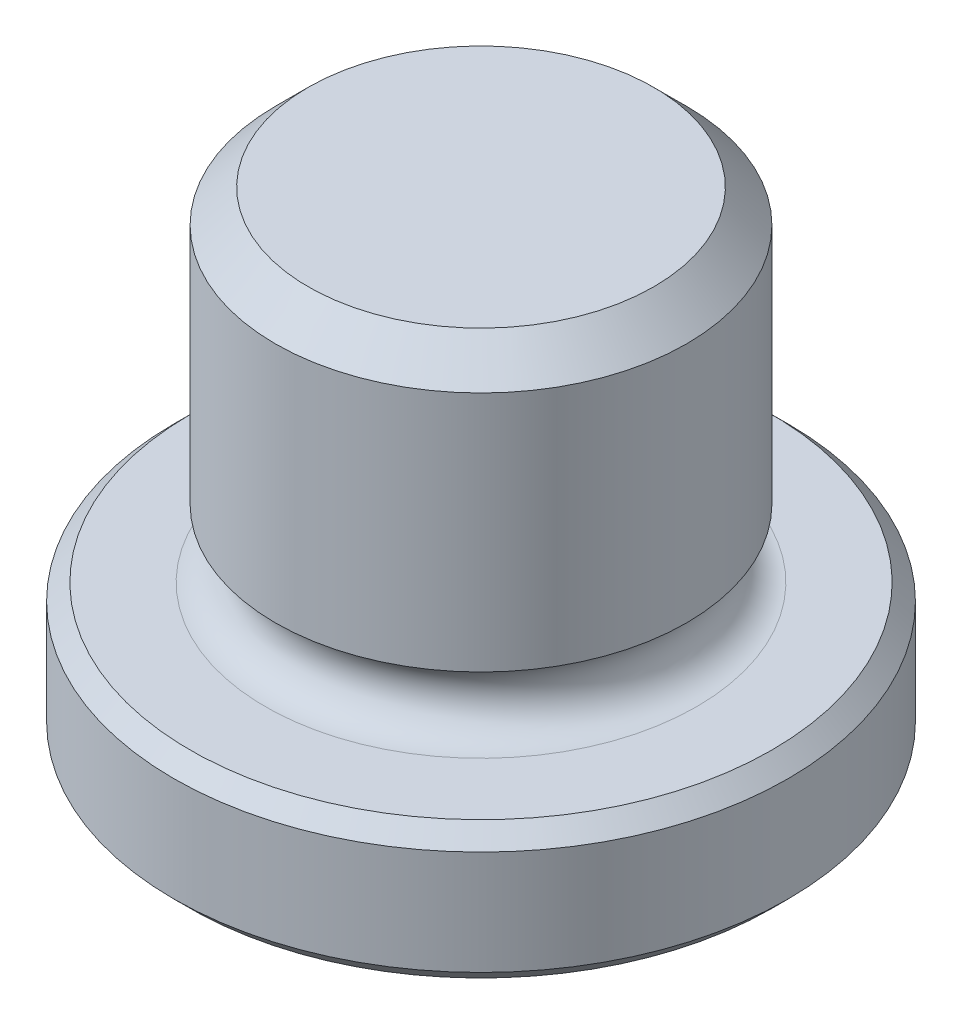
ISO-10303-21;
HEADER;
FILE_DESCRIPTION(('STEP AP214'),'2;1');
FILE_NAME('part.step','',(''),(''),'','','');
FILE_SCHEMA(('AUTOMOTIVE_DESIGN { 1 0 10303 214 1 1 1 1 }'));
ENDSEC;
DATA;
#1=APPLICATION_CONTEXT('core data for automotive mechanical design processes');
#2=APPLICATION_PROTOCOL_DEFINITION('international standard','automotive_design',2000,#1);
#3=PRODUCT_CONTEXT('',#1,'mechanical');
#4=PRODUCT('Part','Part','',(#3));
#5=PRODUCT_RELATED_PRODUCT_CATEGORY('part','',(#4));
#6=PRODUCT_DEFINITION_FORMATION('','',#4);
#7=PRODUCT_DEFINITION_CONTEXT('part definition',#1,'design');
#8=PRODUCT_DEFINITION('design','',#6,#7);
#9=PRODUCT_DEFINITION_SHAPE('','',#8);
#10=(LENGTH_UNIT() NAMED_UNIT(*) SI_UNIT(.MILLI.,.METRE.));
#11=(NAMED_UNIT(*) PLANE_ANGLE_UNIT() SI_UNIT($,.RADIAN.));
#12=(NAMED_UNIT(*) SI_UNIT($,.STERADIAN.) SOLID_ANGLE_UNIT());
#13=UNCERTAINTY_MEASURE_WITH_UNIT(LENGTH_MEASURE(1.E-05),#10,'distance_accuracy_value','');
#14=(GEOMETRIC_REPRESENTATION_CONTEXT(3) GLOBAL_UNCERTAINTY_ASSIGNED_CONTEXT((#13)) GLOBAL_UNIT_ASSIGNED_CONTEXT((#10,
#11,#12)) REPRESENTATION_CONTEXT('',''));
#15=CARTESIAN_POINT('',(0.,0.,0.));
#16=DIRECTION('',(0.,0.,1.));
#17=DIRECTION('',(1.,0.,0.));
#18=AXIS2_PLACEMENT_3D('',#15,#16,#17);
#19=CARTESIAN_POINT('',(4.0005,11.0998,0.));
#20=DIRECTION('',(0.,-1.,0.));
#21=DIRECTION('',(1.,0.,0.));
#22=AXIS2_PLACEMENT_3D('',#19,#20,#21);
#23=PLANE('',#22);
#24=CARTESIAN_POINT('',(0.,11.0998,0.));
#25=DIRECTION('',(0.,1.,0.));
#26=DIRECTION('',(-1.,0.,0.));
#27=AXIS2_PLACEMENT_3D('',#24,#25,#26);
#28=CIRCLE('',#27,4.0005);
#29=CARTESIAN_POINT('',(-4.0005,11.0998,0.));
#30=VERTEX_POINT('',#29);
#31=EDGE_CURVE('E52',#30,#30,#28,.T.);
#32=ORIENTED_EDGE('',*,*,#31,.T.);
#33=EDGE_LOOP('',(#32));
#34=FACE_BOUND('',#33,.T.);
#35=ADVANCED_FACE('F39',(#34),#23,.F.);
#36=CARTESIAN_POINT('',(0.,10.3378,0.));
#37=DIRECTION('',(0.,-1.,0.));
#38=DIRECTION('',(1.,0.,0.));
#39=AXIS2_PLACEMENT_3D('',#36,#37,#38);
#40=CONICAL_SURFACE('',#39,4.7625,0.785398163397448);
#41=ORIENTED_EDGE('',*,*,#31,.F.);
#42=EDGE_LOOP('',(#41));
#43=FACE_BOUND('',#42,.T.);
#44=CARTESIAN_POINT('',(0.,10.3378,0.));
#45=DIRECTION('',(0.,1.,0.));
#46=DIRECTION('',(-1.,0.,0.));
#47=AXIS2_PLACEMENT_3D('',#44,#45,#46);
#48=CIRCLE('',#47,4.7625);
#49=CARTESIAN_POINT('',(-4.7625,10.3378,0.));
#50=VERTEX_POINT('',#49);
#51=EDGE_CURVE('E143',#50,#50,#48,.T.);
#52=ORIENTED_EDGE('',*,*,#51,.T.);
#53=EDGE_LOOP('',(#52));
#54=FACE_BOUND('',#53,.T.);
#55=ADVANCED_FACE('F149',(#43,#54),#40,.T.);
#56=CARTESIAN_POINT('',(0.,11.0998,0.));
#57=DIRECTION('',(0.,1.,0.));
#58=DIRECTION('',(-1.,0.,0.));
#59=AXIS2_PLACEMENT_3D('',#56,#57,#58);
#60=CYLINDRICAL_SURFACE('',#59,4.7625);
#61=ORIENTED_EDGE('',*,*,#51,.F.);
#62=EDGE_LOOP('',(#61));
#63=FACE_BOUND('',#62,.T.);
#64=CARTESIAN_POINT('',(0.,4.7431750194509,0.));
#65=DIRECTION('',(0.,1.,0.));
#66=DIRECTION('',(-1.,0.,0.));
#67=AXIS2_PLACEMENT_3D('',#64,#65,#66);
#68=CIRCLE('',#67,4.7625);
#69=CARTESIAN_POINT('',(-4.7625,4.7431750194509,0.));
#70=VERTEX_POINT('',#69);
#71=EDGE_CURVE('E140',#70,#70,#68,.T.);
#72=ORIENTED_EDGE('',*,*,#71,.T.);
#73=EDGE_LOOP('',(#72));
#74=FACE_BOUND('',#73,.T.);
#75=ADVANCED_FACE('F152',(#63,#74),#60,.T.);
#76=CARTESIAN_POINT('',(0.,4.72675409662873,0.));
#77=DIRECTION('',(0.,1.,0.));
#78=DIRECTION('',(-1.,0.,0.));
#79=AXIS2_PLACEMENT_3D('',#76,#77,#78);
#80=CONICAL_SURFACE('',#79,4.71738388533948,1.22173047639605);
#81=ORIENTED_EDGE('',*,*,#71,.F.);
#82=EDGE_LOOP('',(#81));
#83=FACE_BOUND('',#82,.T.);
#84=CARTESIAN_POINT('',(0.,4.72675409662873,0.));
#85=DIRECTION('',(0.,1.,0.));
#86=DIRECTION('',(-1.,0.,0.));
#87=AXIS2_PLACEMENT_3D('',#84,#85,#86);
#88=CIRCLE('',#87,4.71738388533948);
#89=CARTESIAN_POINT('',(-4.71738388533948,4.72675409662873,0.));
#90=VERTEX_POINT('',#89);
#91=EDGE_CURVE('E137',#90,#90,#88,.T.);
#92=ORIENTED_EDGE('',*,*,#91,.T.);
#93=EDGE_LOOP('',(#92));
#94=FACE_BOUND('',#93,.T.);
#95=ADVANCED_FACE('F157',(#83,#94),#80,.T.);
#96=CARTESIAN_POINT('',(0.,3.975,0.));
#97=DIRECTION('',(0.,1.,0.));
#98=DIRECTION('',(-1.,0.,0.));
#99=AXIS2_PLACEMENT_3D('',#96,#97,#98);
#100=TOROIDAL_SURFACE('',#99,4.991,0.8);
#101=ORIENTED_EDGE('',*,*,#91,.F.);
#102=EDGE_LOOP('',(#101));
#103=FACE_BOUND('',#102,.T.);
#104=CARTESIAN_POINT('',(0.,3.175,0.));
#105=DIRECTION('',(0.,1.,0.));
#106=DIRECTION('',(-1.,0.,0.));
#107=AXIS2_PLACEMENT_3D('',#104,#105,#106);
#108=CIRCLE('',#107,4.991);
#109=CARTESIAN_POINT('',(-4.991,3.175,0.));
#110=VERTEX_POINT('',#109);
#111=EDGE_CURVE('E134',#110,#110,#108,.T.);
#112=ORIENTED_EDGE('',*,*,#111,.T.);
#113=EDGE_LOOP('',(#112));
#114=FACE_BOUND('',#113,.T.);
#115=ADVANCED_FACE('F163',(#103,#114),#100,.F.);
#116=CARTESIAN_POINT('',(6.731,3.175,0.));
#117=DIRECTION('',(0.,-1.,0.));
#118=DIRECTION('',(1.,0.,0.));
#119=AXIS2_PLACEMENT_3D('',#116,#117,#118);
#120=PLANE('',#119);
#121=ORIENTED_EDGE('',*,*,#111,.F.);
#122=EDGE_LOOP('',(#121));
#123=FACE_BOUND('',#122,.T.);
#124=CARTESIAN_POINT('',(0.,3.175,0.));
#125=DIRECTION('',(0.,1.,0.));
#126=DIRECTION('',(-1.,0.,0.));
#127=AXIS2_PLACEMENT_3D('',#124,#125,#126);
#128=CIRCLE('',#127,6.731);
#129=CARTESIAN_POINT('',(-6.731,3.175,0.));
#130=VERTEX_POINT('',#129);
#131=EDGE_CURVE('E131',#130,#130,#128,.T.);
#132=ORIENTED_EDGE('',*,*,#131,.T.);
#133=EDGE_LOOP('',(#132));
#134=FACE_BOUND('',#133,.T.);
#135=ADVANCED_FACE('F169',(#123,#134),#120,.F.);
#136=CARTESIAN_POINT('',(0.,2.794,0.));
#137=DIRECTION('',(0.,-1.,0.));
#138=DIRECTION('',(1.,0.,0.));
#139=AXIS2_PLACEMENT_3D('',#136,#137,#138);
#140=CONICAL_SURFACE('',#139,7.112,0.785398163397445);
#141=ORIENTED_EDGE('',*,*,#131,.F.);
#142=EDGE_LOOP('',(#141));
#143=FACE_BOUND('',#142,.T.);
#144=CARTESIAN_POINT('',(0.,2.794,0.));
#145=DIRECTION('',(0.,1.,0.));
#146=DIRECTION('',(-1.,0.,0.));
#147=AXIS2_PLACEMENT_3D('',#144,#145,#146);
#148=CIRCLE('',#147,7.112);
#149=CARTESIAN_POINT('',(-7.112,2.794,0.));
#150=VERTEX_POINT('',#149);
#151=EDGE_CURVE('E128',#150,#150,#148,.T.);
#152=ORIENTED_EDGE('',*,*,#151,.T.);
#153=EDGE_LOOP('',(#152));
#154=FACE_BOUND('',#153,.T.);
#155=ADVANCED_FACE('F175',(#143,#154),#140,.T.);
#156=CARTESIAN_POINT('',(0.,11.0998,0.));
#157=DIRECTION('',(0.,1.,0.));
#158=DIRECTION('',(-1.,0.,0.));
#159=AXIS2_PLACEMENT_3D('',#156,#157,#158);
#160=CYLINDRICAL_SURFACE('',#159,7.112);
#161=ORIENTED_EDGE('',*,*,#151,.F.);
#162=EDGE_LOOP('',(#161));
#163=FACE_BOUND('',#162,.T.);
#164=CARTESIAN_POINT('',(0.,0.380999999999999,0.));
#165=DIRECTION('',(0.,1.,0.));
#166=DIRECTION('',(-1.,0.,0.));
#167=AXIS2_PLACEMENT_3D('',#164,#165,#166);
#168=CIRCLE('',#167,7.112);
#169=CARTESIAN_POINT('',(-7.112,0.381,0.));
#170=VERTEX_POINT('',#169);
#171=EDGE_CURVE('E125',#170,#170,#168,.T.);
#172=ORIENTED_EDGE('',*,*,#171,.T.);
#173=EDGE_LOOP('',(#172));
#174=FACE_BOUND('',#173,.T.);
#175=ADVANCED_FACE('F181',(#163,#174),#160,.T.);
#176=CARTESIAN_POINT('',(0.,0.,0.));
#177=DIRECTION('',(0.,1.,0.));
#178=DIRECTION('',(-1.,0.,0.));
#179=AXIS2_PLACEMENT_3D('',#176,#177,#178);
#180=CONICAL_SURFACE('',#179,6.731,0.78539816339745);
#181=ORIENTED_EDGE('',*,*,#171,.F.);
#182=EDGE_LOOP('',(#181));
#183=FACE_BOUND('',#182,.T.);
#184=CARTESIAN_POINT('',(0.,0.,0.));
#185=DIRECTION('',(0.,1.,0.));
#186=DIRECTION('',(-1.,0.,0.));
#187=AXIS2_PLACEMENT_3D('',#184,#185,#186);
#188=CIRCLE('',#187,6.731);
#189=CARTESIAN_POINT('',(-6.731,0.,0.));
#190=VERTEX_POINT('',#189);
#191=EDGE_CURVE('E122',#190,#190,#188,.T.);
#192=ORIENTED_EDGE('',*,*,#191,.T.);
#193=EDGE_LOOP('',(#192));
#194=FACE_BOUND('',#193,.T.);
#195=ADVANCED_FACE('F187',(#183,#194),#180,.T.);
#196=CARTESIAN_POINT('',(0.,0.,0.));
#197=DIRECTION('',(0.,1.,0.));
#198=DIRECTION('',(-1.,0.,0.));
#199=AXIS2_PLACEMENT_3D('',#196,#197,#198);
#200=PLANE('',#199);
#201=CARTESIAN_POINT('',(0.,0.,0.));
#202=DIRECTION('',(0.,1.,0.));
#203=DIRECTION('',(-1.,0.,0.));
#204=AXIS2_PLACEMENT_3D('',#201,#202,#203);
#205=CIRCLE('',#204,3.00363065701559);
#206=CARTESIAN_POINT('',(-3.00363065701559,0.,0.));
#207=VERTEX_POINT('',#206);
#208=EDGE_CURVE('E421',#207,#207,#205,.T.);
#209=ORIENTED_EDGE('',*,*,#208,.T.);
#210=EDGE_LOOP('',(#209));
#211=FACE_BOUND('',#210,.T.);
#212=ORIENTED_EDGE('',*,*,#191,.F.);
#213=EDGE_LOOP('',(#212));
#214=FACE_BOUND('',#213,.T.);
#215=ADVANCED_FACE('F193',(#211,#214),#200,.F.);
#216=CARTESIAN_POINT('',(0.,1.524,0.));
#217=DIRECTION('',(0.,-1.,0.));
#218=DIRECTION('',(1.,0.,0.));
#219=AXIS2_PLACEMENT_3D('',#216,#217,#218);
#220=CONICAL_SURFACE('',#219,1.47963065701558,0.785398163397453);
#221=ORIENTED_EDGE('',*,*,#208,.F.);
#222=EDGE_LOOP('',(#221));
#223=FACE_BOUND('',#222,.T.);
#224=CARTESIAN_POINT('',(2.74974612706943,0.253884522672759,-0.000199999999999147));
#225=CARTESIAN_POINT('',(2.70248609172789,0.30110510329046,0.0816567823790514));
#226=CARTESIAN_POINT('',(2.65443579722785,0.345552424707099,0.164882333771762));
#227=CARTESIAN_POINT('',(2.556455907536,0.426934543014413,0.334588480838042));
#228=CARTESIAN_POINT('',(2.50651699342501,0.463824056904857,0.421085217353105));
#229=CARTESIAN_POINT('',(2.40581754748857,0.527016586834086,0.595501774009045));
#230=CARTESIAN_POINT('',(2.35508266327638,0.553478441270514,0.683377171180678));
#231=CARTESIAN_POINT('',(2.25249593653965,0.594248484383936,0.861062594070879));
#232=CARTESIAN_POINT('',(2.20064722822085,0.608587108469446,0.950867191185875));
#233=CARTESIAN_POINT('',(2.11128933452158,0.621524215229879,1.10563960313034));
#234=CARTESIAN_POINT('',(2.07389560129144,0.62343939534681,1.17040744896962));
#235=CARTESIAN_POINT('',(1.99916925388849,0.62021337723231,1.29983727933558));
#236=CARTESIAN_POINT('',(1.96183666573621,0.615069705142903,1.36449921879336));
#237=CARTESIAN_POINT('',(1.8875239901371,0.598018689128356,1.49321254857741));
#238=CARTESIAN_POINT('',(1.85054434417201,0.586103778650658,1.55726317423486));
#239=CARTESIAN_POINT('',(1.77722451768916,0.556164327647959,1.68425683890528));
#240=CARTESIAN_POINT('',(1.74088428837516,0.53814025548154,1.74719996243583));
#241=CARTESIAN_POINT('',(1.64780030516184,0.484631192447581,1.90842615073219));
#242=CARTESIAN_POINT('',(1.59163374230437,0.44511257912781,2.00570949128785));
#243=CARTESIAN_POINT('',(1.50904576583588,0.378399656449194,2.14875606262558));
#244=CARTESIAN_POINT('',(1.48182934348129,0.354959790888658,2.19589628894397));
#245=CARTESIAN_POINT('',(1.42790064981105,0.305943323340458,2.28930352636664));
#246=CARTESIAN_POINT('',(1.40118808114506,0.28036803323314,2.33557105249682));
#247=CARTESIAN_POINT('',(1.37469985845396,0.253884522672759,2.38145));
#248=B_SPLINE_CURVE_WITH_KNOTS('',3,(#224,#225,#226,#227,#228,#229,#230,#231,#232,#233,#234,
#235,#236,#237,#238,#239,#240,#241,#242,#243,#244,#245,#246,#247),.UNSPECIFIED.,.F.,.F.,(4,2,2,
2,2,2,2,2,2,2,2,4),(0.,0.31719661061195,0.63624146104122,0.950218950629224,1.26340583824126,
1.48752413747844,1.71172100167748,1.93616888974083,2.16059957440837,2.51709639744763,
2.69486147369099,2.87251813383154),.UNSPECIFIED.);
#249=CARTESIAN_POINT('',(2.74963065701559,0.253999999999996,0.));
#250=VERTEX_POINT('',#249);
#251=CARTESIAN_POINT('',(1.3748153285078,0.253999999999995,2.38125));
#252=VERTEX_POINT('',#251);
#253=EDGE_CURVE('E106',#250,#252,#248,.T.);
#254=ORIENTED_EDGE('',*,*,#253,.F.);
#255=CARTESIAN_POINT('',(1.37469985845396,0.253884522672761,-2.38145));
#256=CARTESIAN_POINT('',(1.4219598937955,0.301105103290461,-2.29959321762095));
#257=CARTESIAN_POINT('',(1.47001018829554,0.3455524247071,-2.21636766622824));
#258=CARTESIAN_POINT('',(1.56799007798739,0.426934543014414,-2.04666151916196));
#259=CARTESIAN_POINT('',(1.61792899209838,0.463824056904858,-1.9601647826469));
#260=CARTESIAN_POINT('',(1.71862843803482,0.527016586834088,-1.78574822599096));
#261=CARTESIAN_POINT('',(1.76936332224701,0.553478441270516,-1.69787282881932));
#262=CARTESIAN_POINT('',(1.87195004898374,0.594248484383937,-1.52018740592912));
#263=CARTESIAN_POINT('',(1.92379875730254,0.608587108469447,-1.43038280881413));
#264=CARTESIAN_POINT('',(2.01315665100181,0.621524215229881,-1.27561039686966));
#265=CARTESIAN_POINT('',(2.05055038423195,0.623439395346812,-1.21084255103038));
#266=CARTESIAN_POINT('',(2.1252767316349,0.620213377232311,-1.08141272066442));
#267=CARTESIAN_POINT('',(2.16260931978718,0.615069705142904,-1.01675078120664));
#268=CARTESIAN_POINT('',(2.23692199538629,0.598018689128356,-0.888037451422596));
#269=CARTESIAN_POINT('',(2.27390164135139,0.586103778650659,-0.823986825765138));
#270=CARTESIAN_POINT('',(2.34722146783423,0.55616432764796,-0.696993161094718));
#271=CARTESIAN_POINT('',(2.38356169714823,0.538140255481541,-0.634050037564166));
#272=CARTESIAN_POINT('',(2.47664568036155,0.484631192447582,-0.47282384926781));
#273=CARTESIAN_POINT('',(2.53281224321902,0.445112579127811,-0.375540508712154));
#274=CARTESIAN_POINT('',(2.61540021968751,0.378399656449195,-0.232493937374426));
#275=CARTESIAN_POINT('',(2.6426166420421,0.354959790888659,-0.185353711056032));
#276=CARTESIAN_POINT('',(2.69654533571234,0.30594332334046,-0.0919464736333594));
#277=CARTESIAN_POINT('',(2.72325790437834,0.280368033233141,-0.0456789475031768));
#278=CARTESIAN_POINT('',(2.74974612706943,0.253884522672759,0.000200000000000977));
#279=B_SPLINE_CURVE_WITH_KNOTS('',3,(#255,#256,#257,#258,#259,#260,#261,#262,#263,#264,#265,
#266,#267,#268,#269,#270,#271,#272,#273,#274,#275,#276,#277,#278),.UNSPECIFIED.,.F.,.F.,(4,2,2,
2,2,2,2,2,2,2,2,4),(0.,0.317196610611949,0.636241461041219,0.950218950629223,1.26340583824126,
1.48752413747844,1.71172100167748,1.93616888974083,2.16059957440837,2.51709639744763,
2.69486147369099,2.87251813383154),.UNSPECIFIED.);
#280=CARTESIAN_POINT('',(1.3748153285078,0.253999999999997,-2.38125));
#281=VERTEX_POINT('',#280);
#282=EDGE_CURVE('E407',#281,#250,#279,.T.);
#283=ORIENTED_EDGE('',*,*,#282,.F.);
#284=CARTESIAN_POINT('',(-4.51874635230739,-2.10414969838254,-2.38125));
#285=CARTESIAN_POINT('',(-4.38663427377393,-1.98731417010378,-2.38125));
#286=CARTESIAN_POINT('',(-4.2540032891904,-1.87105473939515,-2.38125));
#287=CARTESIAN_POINT('',(-3.98729113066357,-1.64010502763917,-2.38125));
#288=CARTESIAN_POINT('',(-3.85320939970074,-1.52541539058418,-2.38125));
#289=CARTESIAN_POINT('',(-3.58120888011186,-1.29636518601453,-2.38125));
#290=CARTESIAN_POINT('',(-3.44326280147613,-1.18203691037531,-2.38125));
#291=CARTESIAN_POINT('',(-3.16503340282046,-0.956313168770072,-2.38125));
#292=CARTESIAN_POINT('',(-3.02475060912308,-0.84491705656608,-2.38125));
#293=CARTESIAN_POINT('',(-2.74570464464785,-0.629770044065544,-2.38125));
#294=CARTESIAN_POINT('',(-2.60704314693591,-0.525888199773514,-2.38125));
#295=CARTESIAN_POINT('',(-2.32570246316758,-0.323481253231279,-2.38125));
#296=CARTESIAN_POINT('',(-2.18302070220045,-0.224959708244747,-2.38125));
#297=CARTESIAN_POINT('',(-1.89293051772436,-0.0363342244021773,-2.38125));
#298=CARTESIAN_POINT('',(-1.74554455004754,0.0538034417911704,-2.38125));
#299=CARTESIAN_POINT('',(-1.51934349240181,0.179648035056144,-2.38125));
#300=CARTESIAN_POINT('',(-1.44312941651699,0.220017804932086,-2.38125));
#301=CARTESIAN_POINT('',(-1.28875629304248,0.296833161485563,-2.38125));
#302=CARTESIAN_POINT('',(-1.21059781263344,0.333279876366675,-2.38125));
#303=CARTESIAN_POINT('',(-1.05758098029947,0.398944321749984,-2.38125));
#304=CARTESIAN_POINT('',(-0.982862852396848,0.428486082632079,-2.38125));
#305=CARTESIAN_POINT('',(-0.831548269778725,0.482355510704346,-2.38125));
#306=CARTESIAN_POINT('',(-0.754951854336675,0.506683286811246,-2.38125));
#307=CARTESIAN_POINT('',(-0.600423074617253,0.548967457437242,-2.38125));
#308=CARTESIAN_POINT('',(-0.522499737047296,0.566956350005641,-2.38125));
#309=CARTESIAN_POINT('',(-0.365343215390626,0.595754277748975,-2.38125));
#310=CARTESIAN_POINT('',(-0.286110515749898,0.606565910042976,-2.38125));
#311=CARTESIAN_POINT('',(-0.126006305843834,0.620397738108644,-2.38125));
#312=CARTESIAN_POINT('',(-0.0451265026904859,0.623324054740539,-2.38125));
#313=CARTESIAN_POINT('',(0.116505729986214,0.620902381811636,-2.38125));
#314=CARTESIAN_POINT('',(0.19725815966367,0.615554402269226,-2.38125));
#315=CARTESIAN_POINT('',(0.358132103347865,0.596932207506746,-2.38125));
#316=CARTESIAN_POINT('',(0.438250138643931,0.583628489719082,-2.38125));
#317=CARTESIAN_POINT('',(0.596966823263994,0.54991961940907,-2.38125));
#318=CARTESIAN_POINT('',(0.675565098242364,0.529512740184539,-2.38125));
#319=CARTESIAN_POINT('',(0.865071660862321,0.472361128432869,-2.38125));
#320=CARTESIAN_POINT('',(0.974997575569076,0.432377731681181,-2.38125));
#321=CARTESIAN_POINT('',(1.19093340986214,0.342994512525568,-2.38125));
#322=CARTESIAN_POINT('',(1.29694038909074,0.293587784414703,-2.38125));
#323=CARTESIAN_POINT('',(1.50629599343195,0.187414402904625,-2.38125));
#324=CARTESIAN_POINT('',(1.60961416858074,0.130588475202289,-2.38125));
#325=CARTESIAN_POINT('',(1.81316620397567,0.0117916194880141,-2.38125));
#326=CARTESIAN_POINT('',(1.9134011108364,-0.0501775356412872,-2.38125));
#327=CARTESIAN_POINT('',(2.12718035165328,-0.1881641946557,-2.38125));
#328=CARTESIAN_POINT('',(2.2402939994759,-0.264844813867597,-2.38125));
#329=CARTESIAN_POINT('',(2.46388500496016,-0.421973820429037,-2.38125));
#330=CARTESIAN_POINT('',(2.5743618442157,-0.502422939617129,-2.38125));
#331=CARTESIAN_POINT('',(2.79332742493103,-0.666212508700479,-2.38125));
#332=CARTESIAN_POINT('',(2.90181390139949,-0.749555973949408,-2.38125));
#333=CARTESIAN_POINT('',(3.11710515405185,-0.918389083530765,-2.38125));
#334=CARTESIAN_POINT('',(3.22390986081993,-1.00387881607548,-2.38125));
#335=CARTESIAN_POINT('',(3.43118511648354,-1.17248294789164,-2.38125));
#336=CARTESIAN_POINT('',(3.53171796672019,-1.25552094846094,-2.38125));
#337=CARTESIAN_POINT('',(3.73176727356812,-1.42281639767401,-2.38125));
#338=CARTESIAN_POINT('',(3.83128370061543,-1.50707388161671,-2.38125));
#339=CARTESIAN_POINT('',(4.02919746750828,-1.67634325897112,-2.38125));
#340=CARTESIAN_POINT('',(4.12759713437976,-1.76135243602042,-2.38125));
#341=CARTESIAN_POINT('',(4.32367703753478,-1.93218216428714,-2.38125));
#342=CARTESIAN_POINT('',(4.42135732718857,-2.01800265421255,-2.38125));
#343=CARTESIAN_POINT('',(4.51874635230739,-2.10414969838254,-2.38125));
#344=B_SPLINE_CURVE_WITH_KNOTS('',3,(#284,#285,#286,#287,#288,#289,#290,#291,#292,#293,#294,
#295,#296,#297,#298,#299,#300,#301,#302,#303,#304,#305,#306,#307,#308,#309,#310,#311,#312,#313,
#314,#315,#316,#317,#318,#319,#320,#321,#322,#323,#324,#325,#326,#327,#328,#329,#330,#331,#332,
#333,#334,#335,#336,#337,#338,#339,#340,#341,#342,#343),.UNSPECIFIED.,.F.,.F.,(4,2,2,2,2,2,2,2,
2,2,2,2,2,2,2,2,2,2,2,2,2,2,2,2,2,2,2,2,2,4),(0.,0.529099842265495,1.05841060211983,
1.59587609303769,2.13322211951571,2.65290165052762,3.17292195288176,3.69075054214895,
3.94940253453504,4.2079799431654,4.44886073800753,4.68973650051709,4.92935873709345,
5.16889421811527,5.4112691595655,5.65364380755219,5.89692288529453,6.14026114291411,
6.49055027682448,6.84109710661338,7.19463888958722,7.54805930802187,7.95791721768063,
8.36785505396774,8.7782335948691,9.18862903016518,9.57979454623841,9.97097140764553,
10.361071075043,10.7511415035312),.UNSPECIFIED.);
#345=CARTESIAN_POINT('',(-1.3748153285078,0.253999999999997,-2.38125));
#346=VERTEX_POINT('',#345);
#347=EDGE_CURVE('E402',#346,#281,#344,.T.);
#348=ORIENTED_EDGE('',*,*,#347,.F.);
#349=CARTESIAN_POINT('',(-2.74974612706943,0.25388452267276,0.000200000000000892));
#350=CARTESIAN_POINT('',(-2.70248609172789,0.301105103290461,-0.0816567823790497));
#351=CARTESIAN_POINT('',(-2.65443579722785,0.3455524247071,-0.16488233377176));
#352=CARTESIAN_POINT('',(-2.556455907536,0.426934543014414,-0.33458848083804));
#353=CARTESIAN_POINT('',(-2.50651699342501,0.463824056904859,-0.421085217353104));
#354=CARTESIAN_POINT('',(-2.40581754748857,0.527016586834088,-0.595501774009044));
#355=CARTESIAN_POINT('',(-2.35508266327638,0.553478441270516,-0.683377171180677));
#356=CARTESIAN_POINT('',(-2.25249593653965,0.594248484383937,-0.861062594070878));
#357=CARTESIAN_POINT('',(-2.20064722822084,0.608587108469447,-0.950867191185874));
#358=CARTESIAN_POINT('',(-2.11128933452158,0.621524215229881,-1.10563960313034));
#359=CARTESIAN_POINT('',(-2.07389560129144,0.623439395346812,-1.17040744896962));
#360=CARTESIAN_POINT('',(-1.99916925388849,0.620213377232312,-1.29983727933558));
#361=CARTESIAN_POINT('',(-1.96183666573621,0.615069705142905,-1.36449921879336));
#362=CARTESIAN_POINT('',(-1.8875239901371,0.598018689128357,-1.4932125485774));
#363=CARTESIAN_POINT('',(-1.850544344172,0.58610377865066,-1.55726317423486));
#364=CARTESIAN_POINT('',(-1.77722451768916,0.55616432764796,-1.68425683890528));
#365=CARTESIAN_POINT('',(-1.74088428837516,0.538140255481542,-1.74719996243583));
#366=CARTESIAN_POINT('',(-1.64780030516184,0.484631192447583,-1.90842615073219));
#367=CARTESIAN_POINT('',(-1.59163374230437,0.445112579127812,-2.00570949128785));
#368=CARTESIAN_POINT('',(-1.50904576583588,0.378399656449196,-2.14875606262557));
#369=CARTESIAN_POINT('',(-1.48182934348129,0.35495979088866,-2.19589628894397));
#370=CARTESIAN_POINT('',(-1.42790064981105,0.30594332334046,-2.28930352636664));
#371=CARTESIAN_POINT('',(-1.40118808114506,0.280368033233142,-2.33557105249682));
#372=CARTESIAN_POINT('',(-1.37469985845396,0.25388452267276,-2.38145));
#373=B_SPLINE_CURVE_WITH_KNOTS('',3,(#349,#350,#351,#352,#353,#354,#355,#356,#357,#358,#359,
#360,#361,#362,#363,#364,#365,#366,#367,#368,#369,#370,#371,#372),.UNSPECIFIED.,.F.,.F.,(4,2,2,
2,2,2,2,2,2,2,2,4),(0.,0.31719661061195,0.63624146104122,0.950218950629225,1.26340583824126,
1.48752413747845,1.71172100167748,1.93616888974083,2.16059957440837,2.51709639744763,
2.69486147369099,2.87251813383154),.UNSPECIFIED.);
#374=CARTESIAN_POINT('',(-2.74963065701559,0.253999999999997,0.));
#375=VERTEX_POINT('',#374);
#376=EDGE_CURVE('E59',#375,#346,#373,.T.);
#377=ORIENTED_EDGE('',*,*,#376,.F.);
#378=CARTESIAN_POINT('',(-1.37469985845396,0.253884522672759,2.38145));
#379=CARTESIAN_POINT('',(-1.4219598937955,0.30110510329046,2.29959321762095));
#380=CARTESIAN_POINT('',(-1.47001018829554,0.3455524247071,2.21636766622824));
#381=CARTESIAN_POINT('',(-1.56799007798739,0.426934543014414,2.04666151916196));
#382=CARTESIAN_POINT('',(-1.61792899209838,0.463824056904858,1.9601647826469));
#383=CARTESIAN_POINT('',(-1.71862843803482,0.527016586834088,1.78574822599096));
#384=CARTESIAN_POINT('',(-1.76936332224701,0.553478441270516,1.69787282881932));
#385=CARTESIAN_POINT('',(-1.87195004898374,0.594248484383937,1.52018740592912));
#386=CARTESIAN_POINT('',(-1.92379875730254,0.608587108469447,1.43038280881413));
#387=CARTESIAN_POINT('',(-2.01315665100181,0.621524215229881,1.27561039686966));
#388=CARTESIAN_POINT('',(-2.05055038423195,0.623439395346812,1.21084255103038));
#389=CARTESIAN_POINT('',(-2.1252767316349,0.620213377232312,1.08141272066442));
#390=CARTESIAN_POINT('',(-2.16260931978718,0.615069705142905,1.01675078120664));
#391=CARTESIAN_POINT('',(-2.23692199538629,0.598018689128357,0.888037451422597));
#392=CARTESIAN_POINT('',(-2.27390164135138,0.58610377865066,0.823986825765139));
#393=CARTESIAN_POINT('',(-2.34722146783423,0.55616432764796,0.696993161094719));
#394=CARTESIAN_POINT('',(-2.38356169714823,0.538140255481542,0.634050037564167));
#395=CARTESIAN_POINT('',(-2.47664568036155,0.484631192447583,0.472823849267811));
#396=CARTESIAN_POINT('',(-2.53281224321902,0.445112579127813,0.375540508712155));
#397=CARTESIAN_POINT('',(-2.61540021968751,0.378399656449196,0.232493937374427));
#398=CARTESIAN_POINT('',(-2.6426166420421,0.35495979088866,0.185353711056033));
#399=CARTESIAN_POINT('',(-2.69654533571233,0.305943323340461,0.0919464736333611));
#400=CARTESIAN_POINT('',(-2.72325790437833,0.280368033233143,0.0456789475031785));
#401=CARTESIAN_POINT('',(-2.74974612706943,0.253884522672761,-0.000199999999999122));
#402=B_SPLINE_CURVE_WITH_KNOTS('',3,(#378,#379,#380,#381,#382,#383,#384,#385,#386,#387,#388,
#389,#390,#391,#392,#393,#394,#395,#396,#397,#398,#399,#400,#401),.UNSPECIFIED.,.F.,.F.,(4,2,2,
2,2,2,2,2,2,2,2,4),(0.,0.31719661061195,0.63624146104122,0.950218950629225,1.26340583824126,
1.48752413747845,1.71172100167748,1.93616888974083,2.16059957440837,2.51709639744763,
2.69486147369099,2.87251813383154),.UNSPECIFIED.);
#403=CARTESIAN_POINT('',(-1.3748153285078,0.253999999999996,2.38125));
#404=VERTEX_POINT('',#403);
#405=EDGE_CURVE('E11',#404,#375,#402,.T.);
#406=ORIENTED_EDGE('',*,*,#405,.F.);
#407=CARTESIAN_POINT('',(4.51874635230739,-2.10414969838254,2.38125));
#408=CARTESIAN_POINT('',(4.38663427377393,-1.98731417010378,2.38125));
#409=CARTESIAN_POINT('',(4.2540032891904,-1.87105473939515,2.38125));
#410=CARTESIAN_POINT('',(3.98729113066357,-1.64010502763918,2.38125));
#411=CARTESIAN_POINT('',(3.85320939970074,-1.52541539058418,2.38125));
#412=CARTESIAN_POINT('',(3.58120888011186,-1.29636518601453,2.38125));
#413=CARTESIAN_POINT('',(3.44326280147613,-1.18203691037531,2.38125));
#414=CARTESIAN_POINT('',(3.16503340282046,-0.956313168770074,2.38125));
#415=CARTESIAN_POINT('',(3.02475060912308,-0.844917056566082,2.38125));
#416=CARTESIAN_POINT('',(2.74570464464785,-0.629770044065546,2.38125));
#417=CARTESIAN_POINT('',(2.60704314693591,-0.525888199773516,2.38125));
#418=CARTESIAN_POINT('',(2.32570246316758,-0.323481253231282,2.38125));
#419=CARTESIAN_POINT('',(2.18302070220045,-0.22495970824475,2.38125));
#420=CARTESIAN_POINT('',(1.89293051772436,-0.0363342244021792,2.38125));
#421=CARTESIAN_POINT('',(1.74554455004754,0.0538034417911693,2.38125));
#422=CARTESIAN_POINT('',(1.51934349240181,0.179648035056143,2.38125));
#423=CARTESIAN_POINT('',(1.44312941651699,0.220017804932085,2.38125));
#424=CARTESIAN_POINT('',(1.28875629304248,0.296833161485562,2.38125));
#425=CARTESIAN_POINT('',(1.21059781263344,0.333279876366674,2.38125));
#426=CARTESIAN_POINT('',(1.05758098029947,0.398944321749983,2.38125));
#427=CARTESIAN_POINT('',(0.982862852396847,0.428486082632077,2.38125));
#428=CARTESIAN_POINT('',(0.831548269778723,0.482355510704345,2.38125));
#429=CARTESIAN_POINT('',(0.754951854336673,0.506683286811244,2.38125));
#430=CARTESIAN_POINT('',(0.600423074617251,0.548967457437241,2.38125));
#431=CARTESIAN_POINT('',(0.522499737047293,0.56695635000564,2.38125));
#432=CARTESIAN_POINT('',(0.365343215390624,0.595754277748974,2.38125));
#433=CARTESIAN_POINT('',(0.286110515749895,0.606565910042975,2.38125));
#434=CARTESIAN_POINT('',(0.12600630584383,0.620397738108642,2.38125));
#435=CARTESIAN_POINT('',(0.0451265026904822,0.623324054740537,2.38125));
#436=CARTESIAN_POINT('',(-0.116505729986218,0.620902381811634,2.38125));
#437=CARTESIAN_POINT('',(-0.197258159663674,0.615554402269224,2.38125));
#438=CARTESIAN_POINT('',(-0.358132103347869,0.596932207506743,2.38125));
#439=CARTESIAN_POINT('',(-0.438250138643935,0.583628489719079,2.38125));
#440=CARTESIAN_POINT('',(-0.596966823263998,0.549919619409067,2.38125));
#441=CARTESIAN_POINT('',(-0.675565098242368,0.529512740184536,2.38125));
#442=CARTESIAN_POINT('',(-0.865071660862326,0.472361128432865,2.38125));
#443=CARTESIAN_POINT('',(-0.974997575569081,0.432377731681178,2.38125));
#444=CARTESIAN_POINT('',(-1.19093340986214,0.342994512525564,2.38125));
#445=CARTESIAN_POINT('',(-1.29694038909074,0.293587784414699,2.38125));
#446=CARTESIAN_POINT('',(-1.50629599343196,0.18741440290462,2.38125));
#447=CARTESIAN_POINT('',(-1.60961416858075,0.130588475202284,2.38125));
#448=CARTESIAN_POINT('',(-1.81316620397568,0.011791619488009,2.38125));
#449=CARTESIAN_POINT('',(-1.91340111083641,-0.0501775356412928,2.38125));
#450=CARTESIAN_POINT('',(-2.12718035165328,-0.188164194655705,2.38125));
#451=CARTESIAN_POINT('',(-2.24029399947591,-0.264844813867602,2.38125));
#452=CARTESIAN_POINT('',(-2.46388500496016,-0.421973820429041,2.38125));
#453=CARTESIAN_POINT('',(-2.5743618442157,-0.502422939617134,2.38125));
#454=CARTESIAN_POINT('',(-2.79332742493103,-0.666212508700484,2.38125));
#455=CARTESIAN_POINT('',(-2.90181390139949,-0.749555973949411,2.38125));
#456=CARTESIAN_POINT('',(-3.11710515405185,-0.918389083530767,2.38125));
#457=CARTESIAN_POINT('',(-3.22390986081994,-1.00387881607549,2.38125));
#458=CARTESIAN_POINT('',(-3.43118511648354,-1.17248294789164,2.38125));
#459=CARTESIAN_POINT('',(-3.53171796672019,-1.25552094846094,2.38125));
#460=CARTESIAN_POINT('',(-3.73176727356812,-1.42281639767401,2.38125));
#461=CARTESIAN_POINT('',(-3.83128370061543,-1.50707388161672,2.38125));
#462=CARTESIAN_POINT('',(-4.02919746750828,-1.67634325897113,2.38125));
#463=CARTESIAN_POINT('',(-4.12759713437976,-1.76135243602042,2.38125));
#464=CARTESIAN_POINT('',(-4.32367703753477,-1.93218216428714,2.38125));
#465=CARTESIAN_POINT('',(-4.42135732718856,-2.01800265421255,2.38125));
#466=CARTESIAN_POINT('',(-4.51874635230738,-2.10414969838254,2.38125));
#467=B_SPLINE_CURVE_WITH_KNOTS('',3,(#407,#408,#409,#410,#411,#412,#413,#414,#415,#416,#417,
#418,#419,#420,#421,#422,#423,#424,#425,#426,#427,#428,#429,#430,#431,#432,#433,#434,#435,#436,
#437,#438,#439,#440,#441,#442,#443,#444,#445,#446,#447,#448,#449,#450,#451,#452,#453,#454,#455,
#456,#457,#458,#459,#460,#461,#462,#463,#464,#465,#466),.UNSPECIFIED.,.F.,.F.,(4,2,2,2,2,2,2,2,
2,2,2,2,2,2,2,2,2,2,2,2,2,2,2,2,2,2,2,2,2,4),(0.,0.529099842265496,1.05841060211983,
1.59587609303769,2.13322211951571,2.65290165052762,3.17292195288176,3.69075054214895,
3.94940253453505,4.20797994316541,4.44886073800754,4.68973650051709,4.92935873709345,
5.16889421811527,5.41126915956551,5.65364380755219,5.89692288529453,6.14026114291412,
6.49055027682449,6.84109710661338,7.19463888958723,7.54805930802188,7.95791721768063,
8.36785505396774,8.77823359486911,9.18862903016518,9.57979454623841,9.97097140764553,
10.361071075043,10.7511415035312),.UNSPECIFIED.);
#468=EDGE_CURVE('E97',#252,#404,#467,.T.);
#469=ORIENTED_EDGE('',*,*,#468,.F.);
#470=EDGE_LOOP('',(#254,#283,#348,#377,#406,#469));
#471=FACE_BOUND('',#470,.T.);
#472=ADVANCED_FACE('F96',(#223,#471),#220,.F.);
#473=CARTESIAN_POINT('',(0.,7.874,0.));
#474=DIRECTION('',(0.,-1.,0.));
#475=DIRECTION('',(1.,0.,0.));
#476=AXIS2_PLACEMENT_3D('',#473,#474,#475);
#477=PLANE('',#476);
#478=DIRECTION('',(-1.,0.,0.));
#479=VECTOR('',#478,1.);
#480=CARTESIAN_POINT('',(1.3748153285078,7.874,2.38125));
#481=LINE('',#480,#479);
#482=CARTESIAN_POINT('',(1.3748153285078,7.874,2.38125));
#483=VERTEX_POINT('',#482);
#484=CARTESIAN_POINT('',(-1.3748153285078,7.874,2.38125));
#485=VERTEX_POINT('',#484);
#486=EDGE_CURVE('E105',#483,#485,#481,.T.);
#487=ORIENTED_EDGE('',*,*,#486,.T.);
#488=DIRECTION('',(-0.5,0.,-0.866025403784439));
#489=VECTOR('',#488,1.);
#490=CARTESIAN_POINT('',(-1.3748153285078,7.874,2.38125));
#491=LINE('',#490,#489);
#492=CARTESIAN_POINT('',(-2.74963065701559,7.874,0.));
#493=VERTEX_POINT('',#492);
#494=EDGE_CURVE('E110',#485,#493,#491,.T.);
#495=ORIENTED_EDGE('',*,*,#494,.T.);
#496=DIRECTION('',(0.5,0.,-0.866025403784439));
#497=VECTOR('',#496,1.);
#498=CARTESIAN_POINT('',(-2.74963065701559,7.874,0.));
#499=LINE('',#498,#497);
#500=CARTESIAN_POINT('',(-1.3748153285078,7.874,-2.38125));
#501=VERTEX_POINT('',#500);
#502=EDGE_CURVE('E437',#493,#501,#499,.T.);
#503=ORIENTED_EDGE('',*,*,#502,.T.);
#504=DIRECTION('',(1.,0.,0.));
#505=VECTOR('',#504,1.);
#506=CARTESIAN_POINT('',(-1.3748153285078,7.874,-2.38125));
#507=LINE('',#506,#505);
#508=CARTESIAN_POINT('',(1.3748153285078,7.874,-2.38125));
#509=VERTEX_POINT('',#508);
#510=EDGE_CURVE('E426',#501,#509,#507,.T.);
#511=ORIENTED_EDGE('',*,*,#510,.T.);
#512=DIRECTION('',(0.5,0.,0.866025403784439));
#513=VECTOR('',#512,1.);
#514=CARTESIAN_POINT('',(1.3748153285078,7.874,-2.38125));
#515=LINE('',#514,#513);
#516=CARTESIAN_POINT('',(2.74963065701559,7.874,0.));
#517=VERTEX_POINT('',#516);
#518=EDGE_CURVE('E118',#509,#517,#515,.T.);
#519=ORIENTED_EDGE('',*,*,#518,.T.);
#520=DIRECTION('',(-0.5,0.,0.866025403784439));
#521=VECTOR('',#520,1.);
#522=CARTESIAN_POINT('',(2.74963065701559,7.874,0.));
#523=LINE('',#522,#521);
#524=EDGE_CURVE('E113',#517,#483,#523,.T.);
#525=ORIENTED_EDGE('',*,*,#524,.T.);
#526=EDGE_LOOP('',(#487,#495,#503,#511,#519,#525));
#527=FACE_BOUND('',#526,.T.);
#528=ADVANCED_FACE('F203',(#527),#477,.T.);
#529=CARTESIAN_POINT('',(-1.3748153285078,7.874,2.38125));
#530=DIRECTION('',(-0.866025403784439,0.,0.5));
#531=DIRECTION('',(0.5,0.,0.866025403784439));
#532=AXIS2_PLACEMENT_3D('',#529,#530,#531);
#533=PLANE('',#532);
#534=DIRECTION('',(0.,-1.,0.));
#535=VECTOR('',#534,1.);
#536=CARTESIAN_POINT('',(-1.3748153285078,7.874,2.38125));
#537=LINE('',#536,#535);
#538=EDGE_CURVE('E103',#485,#404,#537,.T.);
#539=ORIENTED_EDGE('',*,*,#538,.T.);
#540=ORIENTED_EDGE('',*,*,#405,.T.);
#541=DIRECTION('',(0.,-1.,0.));
#542=VECTOR('',#541,1.);
#543=CARTESIAN_POINT('',(-2.74963065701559,7.874,0.));
#544=LINE('',#543,#542);
#545=EDGE_CURVE('E112',#493,#375,#544,.T.);
#546=ORIENTED_EDGE('',*,*,#545,.F.);
#547=ORIENTED_EDGE('',*,*,#494,.F.);
#548=EDGE_LOOP('',(#539,#540,#546,#547));
#549=FACE_BOUND('',#548,.T.);
#550=ADVANCED_FACE('F108',(#549),#533,.F.);
#551=CARTESIAN_POINT('',(-2.74963065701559,7.874,0.));
#552=DIRECTION('',(-0.866025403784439,0.,-0.5));
#553=DIRECTION('',(-0.5,0.,0.866025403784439));
#554=AXIS2_PLACEMENT_3D('',#551,#552,#553);
#555=PLANE('',#554);
#556=ORIENTED_EDGE('',*,*,#545,.T.);
#557=ORIENTED_EDGE('',*,*,#376,.T.);
#558=DIRECTION('',(0.,-1.,0.));
#559=VECTOR('',#558,1.);
#560=CARTESIAN_POINT('',(-1.3748153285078,7.874,-2.38125));
#561=LINE('',#560,#559);
#562=EDGE_CURVE('E115',#501,#346,#561,.T.);
#563=ORIENTED_EDGE('',*,*,#562,.F.);
#564=ORIENTED_EDGE('',*,*,#502,.F.);
#565=EDGE_LOOP('',(#556,#557,#563,#564));
#566=FACE_BOUND('',#565,.T.);
#567=ADVANCED_FACE('F275',(#566),#555,.F.);
#568=CARTESIAN_POINT('',(-1.3748153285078,7.874,-2.38125));
#569=DIRECTION('',(0.,0.,-1.));
#570=DIRECTION('',(-1.,0.,0.));
#571=AXIS2_PLACEMENT_3D('',#568,#569,#570);
#572=PLANE('',#571);
#573=ORIENTED_EDGE('',*,*,#562,.T.);
#574=ORIENTED_EDGE('',*,*,#347,.T.);
#575=DIRECTION('',(0.,-1.,0.));
#576=VECTOR('',#575,1.);
#577=CARTESIAN_POINT('',(1.3748153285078,7.874,-2.38125));
#578=LINE('',#577,#576);
#579=EDGE_CURVE('E428',#509,#281,#578,.T.);
#580=ORIENTED_EDGE('',*,*,#579,.F.);
#581=ORIENTED_EDGE('',*,*,#510,.F.);
#582=EDGE_LOOP('',(#573,#574,#580,#581));
#583=FACE_BOUND('',#582,.T.);
#584=ADVANCED_FACE('F284',(#583),#572,.F.);
#585=CARTESIAN_POINT('',(1.3748153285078,7.874,-2.38125));
#586=DIRECTION('',(0.866025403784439,0.,-0.5));
#587=DIRECTION('',(-0.5,0.,-0.866025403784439));
#588=AXIS2_PLACEMENT_3D('',#585,#586,#587);
#589=PLANE('',#588);
#590=ORIENTED_EDGE('',*,*,#579,.T.);
#591=ORIENTED_EDGE('',*,*,#282,.T.);
#592=DIRECTION('',(0.,-1.,0.));
#593=VECTOR('',#592,1.);
#594=CARTESIAN_POINT('',(2.74963065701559,7.874,0.));
#595=LINE('',#594,#593);
#596=EDGE_CURVE('E429',#517,#250,#595,.T.);
#597=ORIENTED_EDGE('',*,*,#596,.F.);
#598=ORIENTED_EDGE('',*,*,#518,.F.);
#599=EDGE_LOOP('',(#590,#591,#597,#598));
#600=FACE_BOUND('',#599,.T.);
#601=ADVANCED_FACE('F295',(#600),#589,.F.);
#602=CARTESIAN_POINT('',(2.74963065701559,7.874,0.));
#603=DIRECTION('',(0.866025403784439,0.,0.5));
#604=DIRECTION('',(0.5,0.,-0.866025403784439));
#605=AXIS2_PLACEMENT_3D('',#602,#603,#604);
#606=PLANE('',#605);
#607=ORIENTED_EDGE('',*,*,#596,.T.);
#608=ORIENTED_EDGE('',*,*,#253,.T.);
#609=DIRECTION('',(0.,-1.,0.));
#610=VECTOR('',#609,1.);
#611=CARTESIAN_POINT('',(1.3748153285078,7.874,2.38125));
#612=LINE('',#611,#610);
#613=EDGE_CURVE('E66',#483,#252,#612,.T.);
#614=ORIENTED_EDGE('',*,*,#613,.F.);
#615=ORIENTED_EDGE('',*,*,#524,.F.);
#616=EDGE_LOOP('',(#607,#608,#614,#615));
#617=FACE_BOUND('',#616,.T.);
#618=ADVANCED_FACE('F306',(#617),#606,.F.);
#619=CARTESIAN_POINT('',(1.3748153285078,7.874,2.38125));
#620=DIRECTION('',(0.,0.,1.));
#621=DIRECTION('',(1.,0.,0.));
#622=AXIS2_PLACEMENT_3D('',#619,#620,#621);
#623=PLANE('',#622);
#624=ORIENTED_EDGE('',*,*,#613,.T.);
#625=ORIENTED_EDGE('',*,*,#468,.T.);
#626=ORIENTED_EDGE('',*,*,#538,.F.);
#627=ORIENTED_EDGE('',*,*,#486,.F.);
#628=EDGE_LOOP('',(#624,#625,#626,#627));
#629=FACE_BOUND('',#628,.T.);
#630=ADVANCED_FACE('F102',(#629),#623,.F.);
#631=CLOSED_SHELL('',(#35,#55,#75,#95,#115,#135,#155,#175,#195,#215,#472,#528,#550,#567,#584,
#601,#618,#630));
#632=MANIFOLD_SOLID_BREP('B2',#631);
#633=ADVANCED_BREP_SHAPE_REPRESENTATION('',(#18,#632),#14);
#634=SHAPE_DEFINITION_REPRESENTATION(#9,#633);
ENDSEC;
END-ISO-10303-21;
